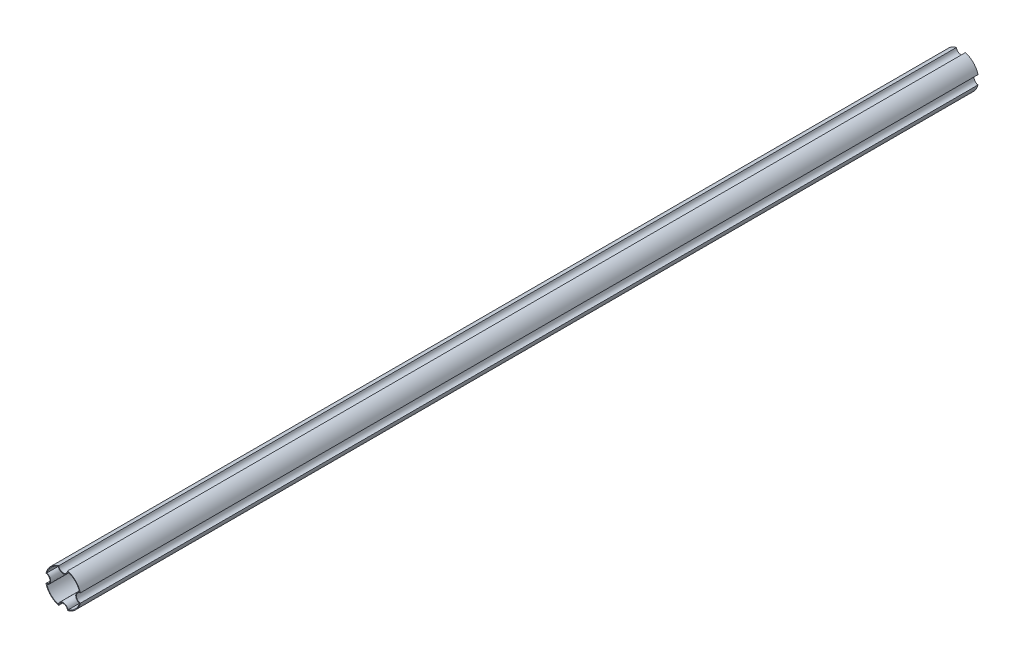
from build123d import *

# Parameters (mm, degrees)
EXTRU_MINCE1_DEPTH = 2000


with BuildPart() as part:
    # Esquisse1 → Extru.-Mince1 (new body)
    with BuildSketch(Plane.XY):
        with BuildLine():
            ThreePointArc((-38.234177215, -9.919561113), (-29.5, 0), (-38.234177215, 9.919561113))
            ThreePointArc((-38.234177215, 9.919561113), (-27.930717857, 27.930717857), (-9.919561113, 38.234177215))
            ThreePointArc((-9.919561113, 38.234177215), (0, 29.5), (9.919561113, 38.234177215))
            ThreePointArc((9.919561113, 38.234177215), (27.930717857, 27.930717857), (38.234177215, 9.919561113))
            ThreePointArc((38.234177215, 9.919561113), (29.5, 0), (38.234177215, -9.919561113))
            ThreePointArc((38.234177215, -9.919561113), (27.930717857, -27.930717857), (9.919561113, -38.234177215))
            ThreePointArc((9.919561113, -38.234177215), (0, -29.5), (-9.919561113, -38.234177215))
            ThreePointArc((-9.919561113, -38.234177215), (-27.930717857, -27.930717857), (-38.234177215, -9.919561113))
        make_face()
        with BuildLine():
            ThreePointArc((-36.35443038, -11.061437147), (-28, 0), (-36.35443038, 11.061437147))
            ThreePointArc((-36.35443038, 11.061437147), (-26.870057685, 26.870057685), (-11.061437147, 36.35443038))
            ThreePointArc((-11.061437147, 36.35443038), (0, 28), (11.061437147, 36.35443038))
            ThreePointArc((11.061437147, 36.35443038), (26.870057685, 26.870057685), (36.35443038, 11.061437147))
            ThreePointArc((36.35443038, 11.061437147), (28, 0), (36.35443038, -11.061437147))
            ThreePointArc((36.35443038, -11.061437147), (26.870057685, -26.870057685), (11.061437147, -36.35443038))
            ThreePointArc((11.061437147, -36.35443038), (0, -28), (-11.061437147, -36.35443038))
            ThreePointArc((-11.061437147, -36.35443038), (-26.870057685, -26.870057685), (-36.35443038, -11.061437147))
        make_face(mode=Mode.SUBTRACT)
    extrude(amount=-EXTRU_MINCE1_DEPTH)


solid = part.part
